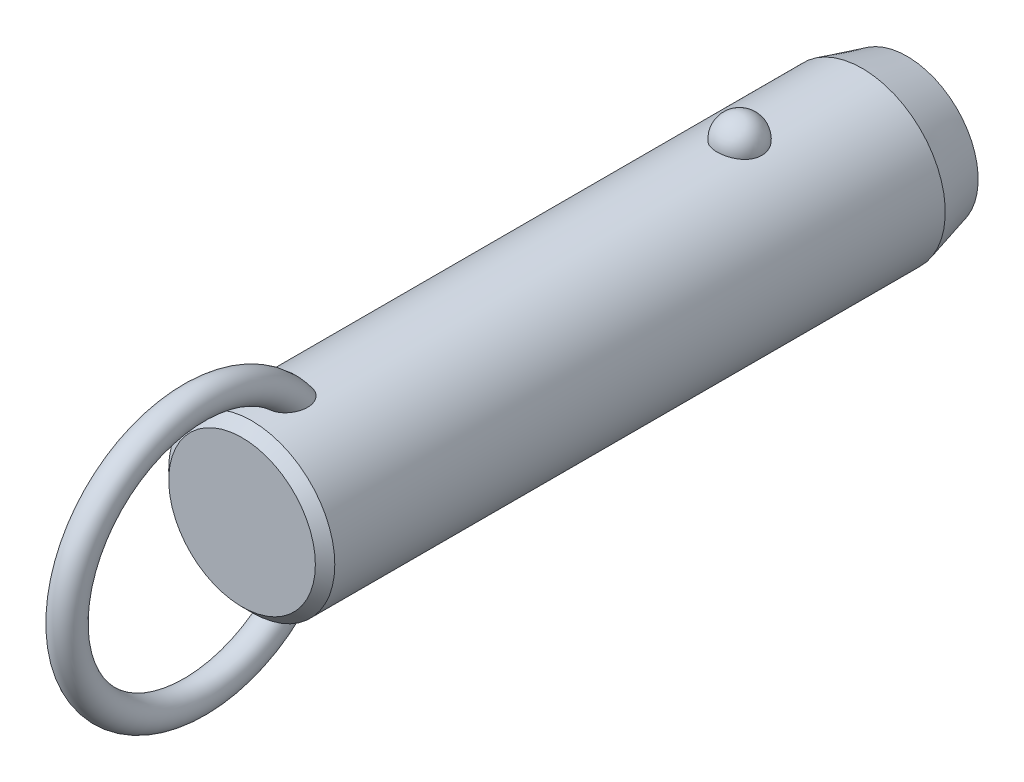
ISO-10303-21;
HEADER;
FILE_DESCRIPTION(('STEP AP214'),'2;1');
FILE_NAME('part.step','',(''),(''),'','','');
FILE_SCHEMA(('AUTOMOTIVE_DESIGN { 1 0 10303 214 1 1 1 1 }'));
ENDSEC;
DATA;
#1=APPLICATION_CONTEXT('core data for automotive mechanical design processes');
#2=APPLICATION_PROTOCOL_DEFINITION('international standard','automotive_design',2000,#1);
#3=PRODUCT_CONTEXT('',#1,'mechanical');
#4=PRODUCT('Part','Part','',(#3));
#5=PRODUCT_RELATED_PRODUCT_CATEGORY('part','',(#4));
#6=PRODUCT_DEFINITION_FORMATION('','',#4);
#7=PRODUCT_DEFINITION_CONTEXT('part definition',#1,'design');
#8=PRODUCT_DEFINITION('design','',#6,#7);
#9=PRODUCT_DEFINITION_SHAPE('','',#8);
#10=(LENGTH_UNIT() NAMED_UNIT(*) SI_UNIT(.MILLI.,.METRE.));
#11=(NAMED_UNIT(*) PLANE_ANGLE_UNIT() SI_UNIT($,.RADIAN.));
#12=(NAMED_UNIT(*) SI_UNIT($,.STERADIAN.) SOLID_ANGLE_UNIT());
#13=UNCERTAINTY_MEASURE_WITH_UNIT(LENGTH_MEASURE(1.E-05),#10,'distance_accuracy_value','');
#14=(GEOMETRIC_REPRESENTATION_CONTEXT(3) GLOBAL_UNCERTAINTY_ASSIGNED_CONTEXT((#13)) GLOBAL_UNIT_ASSIGNED_CONTEXT((#10,
#11,#12)) REPRESENTATION_CONTEXT('',''));
#15=CARTESIAN_POINT('',(0.,0.,0.));
#16=DIRECTION('',(0.,0.,1.));
#17=DIRECTION('',(1.,0.,0.));
#18=AXIS2_PLACEMENT_3D('',#15,#16,#17);
#19=CARTESIAN_POINT('',(0.,0.,50.8));
#20=DIRECTION('',(0.,0.,-1.));
#21=DIRECTION('',(-1.,0.,0.));
#22=AXIS2_PLACEMENT_3D('',#19,#20,#21);
#23=CYLINDRICAL_SURFACE('',#22,11.1);
#24=CARTESIAN_POINT('',(2.9724815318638,10.6945945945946,-3.));
#25=CARTESIAN_POINT('',(2.97247830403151,10.6945972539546,-2.83225059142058));
#26=CARTESIAN_POINT('',(2.95876598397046,10.6984356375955,-2.66445972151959));
#27=CARTESIAN_POINT('',(2.90424529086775,10.7133624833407,-2.33362381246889));
#28=CARTESIAN_POINT('',(2.8634252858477,10.7244540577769,-2.1705808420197));
#29=CARTESIAN_POINT('',(2.75573657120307,10.7526272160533,-1.85396767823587));
#30=CARTESIAN_POINT('',(2.68887937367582,10.7697061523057,-1.70039333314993));
#31=CARTESIAN_POINT('',(2.53079696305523,10.8079438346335,-1.40691598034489));
#32=CARTESIAN_POINT('',(2.43957264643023,10.8291024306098,-1.2670124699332));
#33=CARTESIAN_POINT('',(2.23458150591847,10.8732541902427,-1.00409565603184));
#34=CARTESIAN_POINT('',(2.12071295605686,10.8962553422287,-0.881162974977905));
#35=CARTESIAN_POINT('',(1.87365402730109,10.9414421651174,-0.656352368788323));
#36=CARTESIAN_POINT('',(1.74046358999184,10.9636278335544,-0.554474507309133));
#37=CARTESIAN_POINT('',(1.45872188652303,11.0046495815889,-0.374872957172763));
#38=CARTESIAN_POINT('',(1.31021276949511,11.0234944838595,-0.297085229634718));
#39=CARTESIAN_POINT('',(1.00170030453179,11.0557957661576,-0.167529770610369));
#40=CARTESIAN_POINT('',(0.841698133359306,11.0692526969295,-0.115759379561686));
#41=CARTESIAN_POINT('',(0.517607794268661,11.0890932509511,-0.0403925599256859));
#42=CARTESIAN_POINT('',(0.353633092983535,11.0955916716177,-0.0163383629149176));
#43=CARTESIAN_POINT('',(0.0238420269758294,11.1011989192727,0.0044517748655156));
#44=CARTESIAN_POINT('',(-0.141974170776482,11.1003084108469,0.00119017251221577));
#45=CARTESIAN_POINT('',(-0.468405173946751,11.0912990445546,-0.0323233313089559));
#46=CARTESIAN_POINT('',(-0.629059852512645,11.0832767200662,-0.0622147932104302));
#47=CARTESIAN_POINT('',(-0.942937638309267,11.0609962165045,-0.147645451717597));
#48=CARTESIAN_POINT('',(-1.09616062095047,11.0467379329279,-0.203185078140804));
#49=CARTESIAN_POINT('',(-1.39181061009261,11.0134071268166,-0.3387529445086));
#50=CARTESIAN_POINT('',(-1.53417383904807,10.9943086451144,-0.418913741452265));
#51=CARTESIAN_POINT('',(-1.80342160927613,10.9533667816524,-0.60144882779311));
#52=CARTESIAN_POINT('',(-1.9303046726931,10.9315231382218,-0.703825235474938));
#53=CARTESIAN_POINT('',(-2.16747598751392,10.887005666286,-0.930091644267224));
#54=CARTESIAN_POINT('',(-2.27742774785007,10.8643239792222,-1.05433291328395));
#55=CARTESIAN_POINT('',(-2.47517316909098,10.8209886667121,-1.31966633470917));
#56=CARTESIAN_POINT('',(-2.56296538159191,10.8003351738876,-1.46075958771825));
#57=CARTESIAN_POINT('',(-2.71500300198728,10.7631304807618,-1.75753646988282));
#58=CARTESIAN_POINT('',(-2.77898901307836,10.7466250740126,-1.91335887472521));
#59=CARTESIAN_POINT('',(-2.88046189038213,10.7198747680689,-2.2339152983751));
#60=CARTESIAN_POINT('',(-2.91794947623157,10.709629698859,-2.39864907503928));
#61=CARTESIAN_POINT('',(-2.96537819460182,10.6965949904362,-2.73165170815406));
#62=CARTESIAN_POINT('',(-2.97542891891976,10.693775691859,-2.89990378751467));
#63=CARTESIAN_POINT('',(-2.96804271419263,10.6958279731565,-3.235752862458));
#64=CARTESIAN_POINT('',(-2.95060646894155,10.7006993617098,-3.40334987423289));
#65=CARTESIAN_POINT('',(-2.88883358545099,10.71753912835,-3.73233906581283));
#66=CARTESIAN_POINT('',(-2.84462026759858,10.7294749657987,-3.89375610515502));
#67=CARTESIAN_POINT('',(-2.73050447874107,10.7590797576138,-4.20667949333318));
#68=CARTESIAN_POINT('',(-2.66060103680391,10.7767489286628,-4.35818546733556));
#69=CARTESIAN_POINT('',(-2.49642559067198,10.8159599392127,-4.6478542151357));
#70=CARTESIAN_POINT('',(-2.40203047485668,10.8375211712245,-4.78594458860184));
#71=CARTESIAN_POINT('',(-2.19143488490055,10.8820570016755,-5.0441038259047));
#72=CARTESIAN_POINT('',(-2.07523364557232,10.9050316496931,-5.16417205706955));
#73=CARTESIAN_POINT('',(-1.82361254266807,10.9499219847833,-5.38334833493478));
#74=CARTESIAN_POINT('',(-1.68812945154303,10.9718338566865,-5.48238464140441));
#75=CARTESIAN_POINT('',(-1.40191298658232,11.0120611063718,-5.65618873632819));
#76=CARTESIAN_POINT('',(-1.25118062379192,11.0303767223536,-5.73095813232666));
#77=CARTESIAN_POINT('',(-0.940570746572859,11.0611653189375,-5.85334725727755));
#78=CARTESIAN_POINT('',(-0.780821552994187,11.0737044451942,-5.90127578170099));
#79=CARTESIAN_POINT('',(-0.455204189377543,11.0918598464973,-5.96992976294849));
#80=CARTESIAN_POINT('',(-0.289336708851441,11.0974768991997,-5.99065827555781));
#81=CARTESIAN_POINT('',(0.0406846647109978,11.1011307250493,-6.00418773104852));
#82=CARTESIAN_POINT('',(0.204817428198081,11.099299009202,-5.99747318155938));
#83=CARTESIAN_POINT('',(0.5295530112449,11.088551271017,-5.9574031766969));
#84=CARTESIAN_POINT('',(0.69015594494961,11.0796354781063,-5.92404858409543));
#85=CARTESIAN_POINT('',(1.0027760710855,11.0557204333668,-5.83180084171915));
#86=CARTESIAN_POINT('',(1.15482001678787,11.0407414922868,-5.77299291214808));
#87=CARTESIAN_POINT('',(1.44678373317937,11.0062913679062,-5.63147366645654));
#88=CARTESIAN_POINT('',(1.58670279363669,10.9868199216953,-5.54876095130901));
#89=CARTESIAN_POINT('',(1.8527023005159,10.9451315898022,-5.36027644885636));
#90=CARTESIAN_POINT('',(1.97855158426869,10.9228788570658,-5.25418644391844));
#91=CARTESIAN_POINT('',(2.21080872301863,10.8782509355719,-5.02251354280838));
#92=CARTESIAN_POINT('',(2.31721312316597,10.8558757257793,-4.89692718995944));
#93=CARTESIAN_POINT('',(2.5094551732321,10.8130715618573,-4.62745408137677));
#94=CARTESIAN_POINT('',(2.59493284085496,10.7926798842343,-4.48330448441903));
#95=CARTESIAN_POINT('',(2.740862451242,10.7565495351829,-4.18236358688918));
#96=CARTESIAN_POINT('',(2.80132490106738,10.7408089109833,-4.02557762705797));
#97=CARTESIAN_POINT('',(2.88959070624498,10.7173718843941,-3.72475308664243));
#98=CARTESIAN_POINT('',(2.92062102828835,10.7088950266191,-3.58171216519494));
#99=CARTESIAN_POINT('',(2.96206765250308,10.6975052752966,-3.29245795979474));
#100=CARTESIAN_POINT('',(2.97248434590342,10.6945922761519,-3.14624473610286));
#101=CARTESIAN_POINT('',(2.9724815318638,10.6945945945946,-3.));
#102=B_SPLINE_CURVE_WITH_KNOTS('',3,(#24,#25,#26,#27,#28,#29,#30,#31,#32,#33,#34,#35,#36,#37,
#38,#39,#40,#41,#42,#43,#44,#45,#46,#47,#48,#49,#50,#51,#52,#53,#54,#55,#56,#57,#58,#59,#60,#61,
#62,#63,#64,#65,#66,#67,#68,#69,#70,#71,#72,#73,#74,#75,#76,#77,#78,#79,#80,#81,#82,#83,#84,#85,
#86,#87,#88,#89,#90,#91,#92,#93,#94,#95,#96,#97,#98,#99,#100,#101),.UNSPECIFIED.,.T.,.F.,(4,2,2,
2,2,2,2,2,2,2,2,2,2,2,2,2,2,2,2,2,2,2,2,2,2,2,2,2,2,2,2,2,2,2,2,2,2,2,4),(0.,0.502722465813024,
1.00566079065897,1.5083769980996,2.01107471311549,2.51608392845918,3.02109467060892,
3.52475118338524,4.02835620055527,4.523518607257,5.0186364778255,5.50715297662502,
5.9956776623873,6.48688002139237,6.97812923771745,7.47814366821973,7.9781907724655,
8.48353712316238,8.9888697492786,9.49218093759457,9.99547960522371,10.4964777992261,
10.997494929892,11.5010810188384,12.0046847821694,12.5099796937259,13.0152411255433,
13.5145635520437,14.0138298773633,14.5043200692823,14.9947943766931,15.4836390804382,
15.9725123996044,16.4685040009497,16.9645836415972,17.4686765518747,17.972557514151,
18.410841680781,18.849117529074),.UNSPECIFIED.);
#103=CARTESIAN_POINT('',(2.9724815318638,10.6945945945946,-3.));
#104=VERTEX_POINT('',#103);
#105=EDGE_CURVE('E41',#104,#104,#102,.T.);
#106=ORIENTED_EDGE('',*,*,#105,.T.);
#107=EDGE_LOOP('',(#106));
#108=FACE_BOUND('',#107,.T.);
#109=CARTESIAN_POINT('',(0.,0.,62.2));
#110=DIRECTION('',(0.,0.,1.));
#111=DIRECTION('',(1.,0.,0.));
#112=AXIS2_PLACEMENT_3D('',#109,#110,#111);
#113=CIRCLE('',#112,11.1);
#114=CARTESIAN_POINT('',(11.1,0.,62.2));
#115=VERTEX_POINT('',#114);
#116=EDGE_CURVE('E10',#115,#115,#113,.F.);
#117=ORIENTED_EDGE('',*,*,#116,.T.);
#118=EDGE_LOOP('',(#117));
#119=FACE_BOUND('',#118,.T.);
#120=CARTESIAN_POINT('',(-0.56452033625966,-11.0856356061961,54.4578154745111));
#121=CARTESIAN_POINT('',(-0.66720283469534,-11.0804062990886,54.4912839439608));
#122=CARTESIAN_POINT('',(-0.766875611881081,-11.0738877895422,54.5338357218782));
#123=CARTESIAN_POINT('',(-0.957284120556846,-11.0590576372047,54.6354190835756));
#124=CARTESIAN_POINT('',(-1.04801616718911,-11.0507452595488,54.6944574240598));
#125=CARTESIAN_POINT('',(-1.21800952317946,-11.0333016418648,54.8265293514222));
#126=CARTESIAN_POINT('',(-1.29730805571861,-11.0241732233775,54.8995156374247));
#127=CARTESIAN_POINT('',(-1.44337665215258,-11.0060026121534,55.0570374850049));
#128=CARTESIAN_POINT('',(-1.51014622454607,-10.9969604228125,55.1415734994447));
#129=CARTESIAN_POINT('',(-1.63454620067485,-10.9791841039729,55.3255213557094));
#130=CARTESIAN_POINT('',(-1.69127003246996,-10.9705107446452,55.4255493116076));
#131=CARTESIAN_POINT('',(-1.78980785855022,-10.9548648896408,55.6327902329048));
#132=CARTESIAN_POINT('',(-1.83161214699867,-10.9478935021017,55.7400078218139));
#133=CARTESIAN_POINT('',(-1.91557028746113,-10.9335803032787,56.0054080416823));
#134=CARTESIAN_POINT('',(-1.95040620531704,-10.9273269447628,56.1659806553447));
#135=CARTESIAN_POINT('',(-1.99388326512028,-10.9194709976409,56.4906977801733));
#136=CARTESIAN_POINT('',(-2.00248051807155,-10.9178762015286,56.6548478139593));
#137=CARTESIAN_POINT('',(-1.99551615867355,-10.9191578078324,57.0246504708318));
#138=CARTESIAN_POINT('',(-1.9732206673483,-10.9232807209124,57.2301911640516));
#139=CARTESIAN_POINT('',(-1.9152976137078,-10.9335244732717,57.533595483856));
#140=CARTESIAN_POINT('',(-1.89184575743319,-10.9376266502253,57.6340883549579));
#141=CARTESIAN_POINT('',(-1.83700674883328,-10.9469720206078,57.832855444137));
#142=CARTESIAN_POINT('',(-1.80562070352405,-10.9522150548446,57.9311299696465));
#143=CARTESIAN_POINT('',(-1.73463055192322,-10.9636837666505,58.1259148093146));
#144=CARTESIAN_POINT('',(-1.69493416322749,-10.9699202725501,58.2223907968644));
#145=CARTESIAN_POINT('',(-1.60745141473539,-10.9830806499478,58.4116262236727));
#146=CARTESIAN_POINT('',(-1.55966150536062,-10.9900048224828,58.5043840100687));
#147=CARTESIAN_POINT('',(-1.45591812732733,-11.0042280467,58.6846907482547));
#148=CARTESIAN_POINT('',(-1.40000013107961,-11.0115253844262,58.7722601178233));
#149=CARTESIAN_POINT('',(-1.2793747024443,-11.0261911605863,58.941029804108));
#150=CARTESIAN_POINT('',(-1.21467835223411,-11.0335594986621,59.0222379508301));
#151=CARTESIAN_POINT('',(-1.08218150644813,-11.0473027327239,59.1690010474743));
#152=CARTESIAN_POINT('',(-1.0152263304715,-11.0537063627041,59.2353092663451));
#153=CARTESIAN_POINT('',(-0.872952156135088,-11.065850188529,59.3583780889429));
#154=CARTESIAN_POINT('',(-0.797642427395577,-11.0715911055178,59.4151491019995));
#155=CARTESIAN_POINT('',(-0.651396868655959,-11.081071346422,59.5075155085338));
#156=CARTESIAN_POINT('',(-0.581712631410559,-11.0849841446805,59.5450491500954));
#157=CARTESIAN_POINT('',(-0.4370660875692,-11.0916271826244,59.6082594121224));
#158=CARTESIAN_POINT('',(-0.362109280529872,-11.0943586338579,59.6339481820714));
#159=CARTESIAN_POINT('',(-0.207828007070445,-11.0983242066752,59.671117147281));
#160=CARTESIAN_POINT('',(-0.128467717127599,-11.0995432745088,59.6824545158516));
#161=CARTESIAN_POINT('',(0.0309101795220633,-11.1002423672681,59.6889658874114));
#162=CARTESIAN_POINT('',(0.110927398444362,-11.0997233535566,59.6841488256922));
#163=CARTESIAN_POINT('',(0.256406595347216,-11.097240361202,59.6609599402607));
#164=CARTESIAN_POINT('',(0.322235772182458,-11.0955074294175,59.6447543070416));
#165=CARTESIAN_POINT('',(0.450635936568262,-11.0910350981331,59.6026008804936));
#166=CARTESIAN_POINT('',(0.513205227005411,-11.0882951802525,59.5766480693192));
#167=CARTESIAN_POINT('',(0.66262634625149,-11.0805620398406,59.5026073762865));
#168=CARTESIAN_POINT('',(0.747127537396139,-11.0751144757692,59.4498452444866));
#169=CARTESIAN_POINT('',(0.906756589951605,-11.0631932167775,59.3317206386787));
#170=CARTESIAN_POINT('',(0.981859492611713,-11.0567168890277,59.2663257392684));
#171=CARTESIAN_POINT('',(1.1071220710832,-11.0447856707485,59.1422633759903));
#172=CARTESIAN_POINT('',(1.15909566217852,-11.0394280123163,59.0853831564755));
#173=CARTESIAN_POINT('',(1.25791923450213,-11.0286040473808,58.9673271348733));
#174=CARTESIAN_POINT('',(1.30476642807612,-11.0231376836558,58.9061490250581));
#175=CARTESIAN_POINT('',(1.43818612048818,-11.0068027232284,58.717305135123));
#176=CARTESIAN_POINT('',(1.51751767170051,-10.9960104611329,58.5844531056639));
#177=CARTESIAN_POINT('',(1.63597546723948,-10.9788847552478,58.3531371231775));
#178=CARTESIAN_POINT('',(1.67988876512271,-10.9722190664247,58.2570530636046));
#179=CARTESIAN_POINT('',(1.75953241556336,-10.9597298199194,58.0614311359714));
#180=CARTESIAN_POINT('',(1.79525967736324,-10.9539065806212,57.9618919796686));
#181=CARTESIAN_POINT('',(1.85844731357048,-10.9433632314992,57.7602111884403));
#182=CARTESIAN_POINT('',(1.88591073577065,-10.9386427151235,57.6580705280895));
#183=CARTESIAN_POINT('',(1.93234324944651,-10.9305350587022,57.451819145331));
#184=CARTESIAN_POINT('',(1.95131065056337,-10.9271481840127,57.3477080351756));
#185=CARTESIAN_POINT('',(1.99040203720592,-10.9201183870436,57.0654588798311));
#186=CARTESIAN_POINT('',(2.00221217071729,-10.9179256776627,56.8860370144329));
#187=CARTESIAN_POINT('',(1.99711676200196,-10.9188636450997,56.5277133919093));
#188=CARTESIAN_POINT('',(1.98026150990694,-10.9219849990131,56.3488112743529));
#189=CARTESIAN_POINT('',(1.92151657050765,-10.9324473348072,56.0364514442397));
#190=CARTESIAN_POINT('',(1.88605081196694,-10.9386915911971,55.9017594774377));
#191=CARTESIAN_POINT('',(1.79393020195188,-10.9541780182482,55.6399669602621));
#192=CARTESIAN_POINT('',(1.73729868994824,-10.9634168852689,55.5128582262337));
#193=CARTESIAN_POINT('',(1.61237037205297,-10.9824218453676,55.2894184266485));
#194=CARTESIAN_POINT('',(1.54715374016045,-10.9918945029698,55.1913455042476));
#195=CARTESIAN_POINT('',(1.40127026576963,-11.0114415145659,55.0074341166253));
#196=CARTESIAN_POINT('',(1.3206074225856,-11.0215157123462,54.9215924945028));
#197=CARTESIAN_POINT('',(1.1447478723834,-11.041168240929,54.7651630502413));
#198=CARTESIAN_POINT('',(1.0494780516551,-11.0507437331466,54.6946565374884));
#199=CARTESIAN_POINT('',(0.847278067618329,-11.0680789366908,54.572640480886));
#200=CARTESIAN_POINT('',(0.740351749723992,-11.0758392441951,54.5211246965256));
#201=CARTESIAN_POINT('',(0.52928931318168,-11.0878275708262,54.4434852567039));
#202=CARTESIAN_POINT('',(0.425895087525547,-11.0923259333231,54.415377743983));
#203=CARTESIAN_POINT('',(0.215723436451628,-11.0984001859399,54.3777038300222));
#204=CARTESIAN_POINT('',(0.108947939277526,-11.0999777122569,54.3681270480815));
#205=CARTESIAN_POINT('',(-0.0938962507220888,-11.1000196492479,54.3678773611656));
#206=CARTESIAN_POINT('',(-0.189967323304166,-11.0987797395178,54.3754089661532));
#207=CARTESIAN_POINT('',(-0.379657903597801,-11.0939111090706,54.4055079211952));
#208=CARTESIAN_POINT('',(-0.473277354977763,-11.0902823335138,54.4280756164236));
#209=CARTESIAN_POINT('',(-0.56452033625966,-11.0856356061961,54.4578154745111));
#210=B_SPLINE_CURVE_WITH_KNOTS('',3,(#120,#121,#122,#123,#124,#125,#126,#127,#128,#129,#130,
#131,#132,#133,#134,#135,#136,#137,#138,#139,#140,#141,#142,#143,#144,#145,#146,#147,#148,#149,
#150,#151,#152,#153,#154,#155,#156,#157,#158,#159,#160,#161,#162,#163,#164,#165,#166,#167,#168,
#169,#170,#171,#172,#173,#174,#175,#176,#177,#178,#179,#180,#181,#182,#183,#184,#185,#186,#187,
#188,#189,#190,#191,#192,#193,#194,#195,#196,#197,#198,#199,#200,#201,#202,#203,#204,#205,#206,
#207,#208,#209),.UNSPECIFIED.,.T.,.F.,(4,2,2,2,2,2,2,2,2,2,2,2,2,2,2,2,2,2,2,2,2,2,2,2,2,2,2,2,
2,2,2,2,2,2,2,2,2,2,2,2,2,2,2,2,4),(0.,0.323999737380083,0.648132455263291,0.971184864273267,
1.29424994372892,1.6388623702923,1.98369857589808,2.47426059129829,2.96564271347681,
3.5825739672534,3.89215258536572,4.20168803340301,4.51486273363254,4.82817514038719,
5.14015911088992,5.45175282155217,5.734428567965,6.01679375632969,6.25364580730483,
6.49025437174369,6.72919963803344,6.9680127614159,7.17061258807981,7.37331685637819,
7.67094989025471,7.96935728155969,8.20075067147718,8.43226927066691,8.8958162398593,
9.21306533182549,9.53043400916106,9.84768549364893,10.1650000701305,10.70229304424,
11.2386443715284,11.6553390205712,12.0715755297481,12.4245637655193,12.7774607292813,
13.1321855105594,13.4867936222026,13.8068771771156,14.1267813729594,14.4146787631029,
14.7025827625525),.UNSPECIFIED.);
#211=CARTESIAN_POINT('',(-0.56452033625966,-11.0856356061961,54.4578154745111));
#212=VERTEX_POINT('',#211);
#213=EDGE_CURVE('E60',#212,#212,#210,.T.);
#214=ORIENTED_EDGE('',*,*,#213,.T.);
#215=EDGE_LOOP('',(#214));
#216=FACE_BOUND('',#215,.T.);
#217=CARTESIAN_POINT('',(-0.56452033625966,11.0856356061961,54.4578154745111));
#218=CARTESIAN_POINT('',(-0.468542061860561,11.0905203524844,54.4265456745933));
#219=CARTESIAN_POINT('',(-0.369793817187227,11.0942886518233,54.4031576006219));
#220=CARTESIAN_POINT('',(-0.169555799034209,11.0991586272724,54.3730858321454));
#221=CARTESIAN_POINT('',(-0.0680604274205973,11.1002543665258,54.3664393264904));
#222=CARTESIAN_POINT('',(0.134549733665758,11.099646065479,54.3701579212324));
#223=CARTESIAN_POINT('',(0.235664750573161,11.0979441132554,54.3805103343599));
#224=CARTESIAN_POINT('',(0.434632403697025,11.0919342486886,54.4178318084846));
#225=CARTESIAN_POINT('',(0.532486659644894,11.0876276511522,54.4447924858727));
#226=CARTESIAN_POINT('',(0.722445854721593,11.0768742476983,54.5144096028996));
#227=CARTESIAN_POINT('',(0.814543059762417,11.0704246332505,54.5570866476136));
#228=CARTESIAN_POINT('',(0.990565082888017,11.0560659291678,54.6566487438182));
#229=CARTESIAN_POINT('',(1.07448844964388,11.048156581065,54.7135363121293));
#230=CARTESIAN_POINT('',(1.23562672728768,11.0313221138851,54.8422106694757));
#231=CARTESIAN_POINT('',(1.31242684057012,11.0223686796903,54.9145117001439));
#232=CARTESIAN_POINT('',(1.45398030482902,11.0045918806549,55.0700425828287));
#233=CARTESIAN_POINT('',(1.51873073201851,10.9957685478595,55.1532750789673));
#234=CARTESIAN_POINT('',(1.64107232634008,10.9782087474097,55.3363842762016));
#235=CARTESIAN_POINT('',(1.6974317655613,10.9695572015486,55.4370893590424));
#236=CARTESIAN_POINT('',(1.79515063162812,10.9539887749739,55.6456264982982));
#237=CARTESIAN_POINT('',(1.83649966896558,10.9470730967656,55.7534634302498));
#238=CARTESIAN_POINT('',(1.91931148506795,10.9329211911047,56.0203995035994));
#239=CARTESIAN_POINT('',(1.95340104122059,10.9267904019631,56.1818612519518));
#240=CARTESIAN_POINT('',(1.99526195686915,10.9192174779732,56.5082163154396));
#241=CARTESIAN_POINT('',(2.00298989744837,10.9177830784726,56.6731148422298));
#242=CARTESIAN_POINT('',(1.99396251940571,10.9194420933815,57.0441006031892));
#243=CARTESIAN_POINT('',(1.97050829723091,10.923774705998,57.2500387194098));
#244=CARTESIAN_POINT('',(1.91079643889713,10.9343131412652,57.5539019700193));
#245=CARTESIAN_POINT('',(1.8867370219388,10.9385106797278,57.6545296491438));
#246=CARTESIAN_POINT('',(1.83065508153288,10.9480376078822,57.8535107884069));
#247=CARTESIAN_POINT('',(1.79863369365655,10.9533668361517,57.951864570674));
#248=CARTESIAN_POINT('',(1.72633365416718,10.9649954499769,58.1467203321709));
#249=CARTESIAN_POINT('',(1.68596409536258,10.9713053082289,58.2431879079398));
#250=CARTESIAN_POINT('',(1.59707998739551,10.9845964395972,58.4323233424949));
#251=CARTESIAN_POINT('',(1.54856169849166,10.9915780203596,58.5249894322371));
#252=CARTESIAN_POINT('',(1.4433016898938,11.0058935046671,58.7049752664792));
#253=CARTESIAN_POINT('',(1.38659749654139,11.0132257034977,58.792316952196));
#254=CARTESIAN_POINT('',(1.26431158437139,11.0279330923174,58.9604563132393));
#255=CARTESIAN_POINT('',(1.198741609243,11.0353082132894,59.0412624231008));
#256=CARTESIAN_POINT('',(1.06542088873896,11.048931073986,59.1859856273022));
#257=CARTESIAN_POINT('',(0.998640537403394,11.0552153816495,59.250784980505));
#258=CARTESIAN_POINT('',(0.856896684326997,11.0671032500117,59.3708462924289));
#259=CARTESIAN_POINT('',(0.781942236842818,11.0727075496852,59.4261186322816));
#260=CARTESIAN_POINT('',(0.636276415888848,11.081949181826,59.5159721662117));
#261=CARTESIAN_POINT('',(0.566755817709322,11.0857572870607,59.5524410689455));
#262=CARTESIAN_POINT('',(0.422602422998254,11.0921860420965,59.6135333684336));
#263=CARTESIAN_POINT('',(0.347974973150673,11.0948079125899,59.6381689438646));
#264=CARTESIAN_POINT('',(0.194593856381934,11.0985608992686,59.6733233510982));
#265=CARTESIAN_POINT('',(0.11580793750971,11.0996777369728,59.6837069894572));
#266=CARTESIAN_POINT('',(-0.0422499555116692,11.1002003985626,59.6885747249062));
#267=CARTESIAN_POINT('',(-0.121521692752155,11.09960699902,59.683066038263));
#268=CARTESIAN_POINT('',(-0.266046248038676,11.0970123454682,59.6588271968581));
#269=CARTESIAN_POINT('',(-0.331661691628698,11.0952283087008,59.6421356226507));
#270=CARTESIAN_POINT('',(-0.459588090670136,11.0906663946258,59.5991117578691));
#271=CARTESIAN_POINT('',(-0.521897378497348,11.0878880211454,59.572774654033));
#272=CARTESIAN_POINT('',(-0.671446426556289,11.0800342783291,59.4975130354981));
#273=CARTESIAN_POINT('',(-0.756250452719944,11.0744969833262,59.4438182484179));
#274=CARTESIAN_POINT('',(-0.916349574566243,11.0624045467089,59.3238029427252));
#275=CARTESIAN_POINT('',(-0.991618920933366,11.0558467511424,59.2574493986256));
#276=CARTESIAN_POINT('',(-1.11713140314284,11.0437783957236,59.1316335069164));
#277=CARTESIAN_POINT('',(-1.16920539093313,11.0383619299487,59.0739524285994));
#278=CARTESIAN_POINT('',(-1.26817476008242,11.02743010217,58.9542809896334));
#279=CARTESIAN_POINT('',(-1.315067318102,11.0219146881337,58.8922883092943));
#280=CARTESIAN_POINT('',(-1.40399813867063,11.0109399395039,58.7647843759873));
#281=CARTESIAN_POINT('',(-1.4460286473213,11.0054807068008,58.6992677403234));
#282=CARTESIAN_POINT('',(-1.52538779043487,10.9947621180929,58.5654223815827));
#283=CARTESIAN_POINT('',(-1.56271516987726,10.9895028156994,58.4970929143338));
#284=CARTESIAN_POINT('',(-1.64537943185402,10.9774790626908,58.3332101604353));
#285=CARTESIAN_POINT('',(-1.68879497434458,10.9708503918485,58.2366735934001));
#286=CARTESIAN_POINT('',(-1.76740738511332,10.9584602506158,58.0402369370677));
#287=CARTESIAN_POINT('',(-1.80260120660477,10.95269910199,57.9403356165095));
#288=CARTESIAN_POINT('',(-1.86468657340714,10.9423003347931,57.7379663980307));
#289=CARTESIAN_POINT('',(-1.8915816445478,10.9376622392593,57.6354996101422));
#290=CARTESIAN_POINT('',(-1.93682458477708,10.9297405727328,57.4286429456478));
#291=CARTESIAN_POINT('',(-1.95517082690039,10.9264572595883,57.3242527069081));
#292=CARTESIAN_POINT('',(-1.99232562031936,10.9197647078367,57.0426287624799));
#293=CARTESIAN_POINT('',(-2.00294603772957,10.9177914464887,56.8641857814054));
#294=CARTESIAN_POINT('',(-1.99566675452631,10.9191290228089,56.5079962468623));
#295=CARTESIAN_POINT('',(-1.97781651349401,10.9224306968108,56.3302490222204));
#296=CARTESIAN_POINT('',(-1.91747214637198,10.9331592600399,56.0197921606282));
#297=CARTESIAN_POINT('',(-1.88131022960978,10.9395108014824,55.885825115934));
#298=CARTESIAN_POINT('',(-1.78790380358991,10.9551659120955,55.6255975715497));
#299=CARTESIAN_POINT('',(-1.73068309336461,10.9644661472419,55.4993285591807));
#300=CARTESIAN_POINT('',(-1.60475573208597,10.9835398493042,55.2774156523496));
#301=CARTESIAN_POINT('',(-1.53908879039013,10.9930297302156,55.1800265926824));
#302=CARTESIAN_POINT('',(-1.39238608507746,11.0125708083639,54.9975250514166));
#303=CARTESIAN_POINT('',(-1.31135150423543,11.0226219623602,54.9124116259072));
#304=CARTESIAN_POINT('',(-1.14382035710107,11.0411991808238,54.7652994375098));
#305=CARTESIAN_POINT('',(-1.05858500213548,11.0497792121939,54.7018693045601));
#306=CARTESIAN_POINT('',(-0.878723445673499,11.0655285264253,54.5902505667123));
#307=CARTESIAN_POINT('',(-0.784123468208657,11.0727015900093,54.5420208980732));
#308=CARTESIAN_POINT('',(-0.646163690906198,11.0812501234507,54.486023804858));
#309=CARTESIAN_POINT('',(-0.605595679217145,11.0835451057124,54.4711978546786));
#310=CARTESIAN_POINT('',(-0.56452033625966,11.0856356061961,54.4578154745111));
#311=B_SPLINE_CURVE_WITH_KNOTS('',3,(#217,#218,#219,#220,#221,#222,#223,#224,#225,#226,#227,
#228,#229,#230,#231,#232,#233,#234,#235,#236,#237,#238,#239,#240,#241,#242,#243,#244,#245,#246,
#247,#248,#249,#250,#251,#252,#253,#254,#255,#256,#257,#258,#259,#260,#261,#262,#263,#264,#265,
#266,#267,#268,#269,#270,#271,#272,#273,#274,#275,#276,#277,#278,#279,#280,#281,#282,#283,#284,
#285,#286,#287,#288,#289,#290,#291,#292,#293,#294,#295,#296,#297,#298,#299,#300,#301,#302,#303,
#304,#305,#306,#307,#308,#309,#310),.UNSPECIFIED.,.T.,.F.,(4,2,2,2,2,2,2,2,2,2,2,2,2,2,2,2,2,2,
2,2,2,2,2,2,2,2,2,2,2,2,2,2,2,2,2,2,2,2,2,2,2,2,2,2,2,2,4),(0.,0.303061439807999,
0.60679549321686,0.910302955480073,1.21365733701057,1.51741085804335,1.82121821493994,
2.13745205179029,2.45376252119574,2.799586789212,3.14564996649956,3.63832391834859,
4.13180893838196,4.75031912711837,5.06071926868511,5.37107516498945,5.68500772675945,
5.99908475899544,6.3117651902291,6.62403542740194,6.90315673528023,7.18197194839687,
7.41687778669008,7.65154134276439,7.8884158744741,8.12518286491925,8.32752842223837,
8.52997509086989,8.82986421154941,9.13054668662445,9.36393502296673,9.59744991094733,
9.83133221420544,10.0652767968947,10.383032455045,10.7009056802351,11.0186436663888,
11.3364420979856,11.8705925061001,12.4038159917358,12.8189662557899,13.2336487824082,
13.5857049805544,13.9377340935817,14.2561354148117,14.5736690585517,14.7033687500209),.UNSPECIFIED.);
#312=CARTESIAN_POINT('',(-0.56452033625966,11.0856356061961,54.4578154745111));
#313=VERTEX_POINT('',#312);
#314=EDGE_CURVE('E67',#313,#313,#311,.T.);
#315=ORIENTED_EDGE('',*,*,#314,.T.);
#316=EDGE_LOOP('',(#315));
#317=FACE_BOUND('',#316,.T.);
#318=CARTESIAN_POINT('',(0.,0.,-19.3999999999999));
#319=DIRECTION('',(0.,0.,-1.));
#320=DIRECTION('',(-1.,0.,0.));
#321=AXIS2_PLACEMENT_3D('',#318,#319,#320);
#322=CIRCLE('',#321,11.1);
#323=CARTESIAN_POINT('',(-11.1,0.,-19.3999999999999));
#324=VERTEX_POINT('',#323);
#325=EDGE_CURVE('E57',#324,#324,#322,.F.);
#326=ORIENTED_EDGE('',*,*,#325,.T.);
#327=EDGE_LOOP('',(#326));
#328=FACE_BOUND('',#327,.T.);
#329=ADVANCED_FACE('F37',(#108,#119,#216,#317,#328),#23,.T.);
#330=CARTESIAN_POINT('',(0.,0.,-25.4));
#331=DIRECTION('',(0.,0.,-1.));
#332=DIRECTION('',(-1.,0.,0.));
#333=AXIS2_PLACEMENT_3D('',#330,#331,#332);
#334=PLANE('',#333);
#335=CARTESIAN_POINT('',(0.,0.,-25.4));
#336=DIRECTION('',(0.,0.,-1.));
#337=DIRECTION('',(-1.,0.,0.));
#338=AXIS2_PLACEMENT_3D('',#335,#336,#337);
#339=CIRCLE('',#338,9.49230484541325);
#340=CARTESIAN_POINT('',(-9.49230484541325,0.,-25.4));
#341=VERTEX_POINT('',#340);
#342=EDGE_CURVE('E66',#341,#341,#339,.T.);
#343=ORIENTED_EDGE('',*,*,#342,.T.);
#344=EDGE_LOOP('',(#343));
#345=FACE_BOUND('',#344,.T.);
#346=ADVANCED_FACE('F85',(#345),#334,.T.);
#347=CARTESIAN_POINT('',(0.,0.,-25.4));
#348=DIRECTION('',(0.,0.,1.));
#349=DIRECTION('',(1.,0.,0.));
#350=AXIS2_PLACEMENT_3D('',#347,#348,#349);
#351=CONICAL_SURFACE('',#350,9.49230484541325,0.261799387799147);
#352=ORIENTED_EDGE('',*,*,#325,.F.);
#353=EDGE_LOOP('',(#352));
#354=FACE_BOUND('',#353,.T.);
#355=ORIENTED_EDGE('',*,*,#342,.F.);
#356=EDGE_LOOP('',(#355));
#357=FACE_BOUND('',#356,.T.);
#358=ADVANCED_FACE('F83',(#354,#357),#351,.T.);
#359=CARTESIAN_POINT('',(0.,0.,63.5));
#360=DIRECTION('',(0.,0.,1.));
#361=DIRECTION('',(1.,0.,0.));
#362=AXIS2_PLACEMENT_3D('',#359,#360,#361);
#363=PLANE('',#362);
#364=CARTESIAN_POINT('',(0.,0.,63.5));
#365=DIRECTION('',(0.,0.,1.));
#366=DIRECTION('',(1.,0.,0.));
#367=AXIS2_PLACEMENT_3D('',#364,#365,#366);
#368=CIRCLE('',#367,9.79999999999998);
#369=CARTESIAN_POINT('',(9.79999999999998,0.,63.5));
#370=VERTEX_POINT('',#369);
#371=EDGE_CURVE('E50',#370,#370,#368,.T.);
#372=ORIENTED_EDGE('',*,*,#371,.T.);
#373=EDGE_LOOP('',(#372));
#374=FACE_BOUND('',#373,.T.);
#375=ADVANCED_FACE('F77',(#374),#363,.T.);
#376=CARTESIAN_POINT('',(0.,0.,69.85));
#377=DIRECTION('',(1.,0.,0.));
#378=DIRECTION('',(0.,0.,-1.));
#379=AXIS2_PLACEMENT_3D('',#376,#377,#378);
#380=TOROIDAL_SURFACE('',#379,17.05,2.);
#381=ORIENTED_EDGE('',*,*,#314,.F.);
#382=EDGE_LOOP('',(#381));
#383=FACE_BOUND('',#382,.T.);
#384=ORIENTED_EDGE('',*,*,#213,.F.);
#385=EDGE_LOOP('',(#384));
#386=FACE_BOUND('',#385,.T.);
#387=ADVANCED_FACE('F73',(#383,#386),#380,.T.);
#388=CARTESIAN_POINT('',(0.,0.,63.5));
#389=DIRECTION('',(0.,0.,-1.));
#390=DIRECTION('',(-1.,0.,0.));
#391=AXIS2_PLACEMENT_3D('',#388,#389,#390);
#392=CONICAL_SURFACE('',#391,9.79999999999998,0.785398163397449);
#393=ORIENTED_EDGE('',*,*,#116,.F.);
#394=EDGE_LOOP('',(#393));
#395=FACE_BOUND('',#394,.T.);
#396=ORIENTED_EDGE('',*,*,#371,.F.);
#397=EDGE_LOOP('',(#396));
#398=FACE_BOUND('',#397,.T.);
#399=ADVANCED_FACE('F39',(#395,#398),#392,.T.);
#400=CARTESIAN_POINT('',(0.,11.1,-3.));
#401=DIRECTION('',(0.,1.,0.));
#402=DIRECTION('',(0.,0.,-1.));
#403=AXIS2_PLACEMENT_3D('',#400,#401,#402);
#404=SPHERICAL_SURFACE('',#403,3.);
#405=ORIENTED_EDGE('',*,*,#105,.F.);
#406=EDGE_LOOP('',(#405));
#407=FACE_BOUND('',#406,.T.);
#408=ADVANCED_FACE('F79',(#407),#404,.T.);
#409=CLOSED_SHELL('',(#329,#346,#358,#375,#387,#399,#408));
#410=MANIFOLD_SOLID_BREP('B2',#409);
#411=ADVANCED_BREP_SHAPE_REPRESENTATION('',(#18,#410),#14);
#412=SHAPE_DEFINITION_REPRESENTATION(#9,#411);
ENDSEC;
END-ISO-10303-21;
